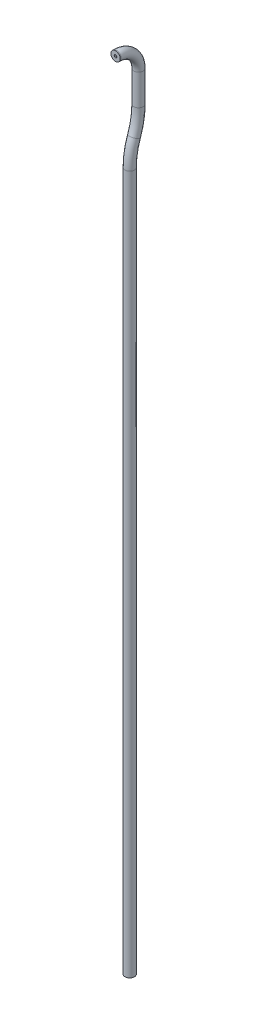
ISO-10303-21;
HEADER;
FILE_DESCRIPTION(('STEP AP214'),'2;1');
FILE_NAME('part.step','',(''),(''),'','','');
FILE_SCHEMA(('AUTOMOTIVE_DESIGN { 1 0 10303 214 1 1 1 1 }'));
ENDSEC;
DATA;
#1=APPLICATION_CONTEXT('core data for automotive mechanical design processes');
#2=APPLICATION_PROTOCOL_DEFINITION('international standard','automotive_design',2000,#1);
#3=PRODUCT_CONTEXT('',#1,'mechanical');
#4=PRODUCT('Part','Part','',(#3));
#5=PRODUCT_RELATED_PRODUCT_CATEGORY('part','',(#4));
#6=PRODUCT_DEFINITION_FORMATION('','',#4);
#7=PRODUCT_DEFINITION_CONTEXT('part definition',#1,'design');
#8=PRODUCT_DEFINITION('design','',#6,#7);
#9=PRODUCT_DEFINITION_SHAPE('','',#8);
#10=(LENGTH_UNIT() NAMED_UNIT(*) SI_UNIT(.MILLI.,.METRE.));
#11=(NAMED_UNIT(*) PLANE_ANGLE_UNIT() SI_UNIT($,.RADIAN.));
#12=(NAMED_UNIT(*) SI_UNIT($,.STERADIAN.) SOLID_ANGLE_UNIT());
#13=UNCERTAINTY_MEASURE_WITH_UNIT(LENGTH_MEASURE(1.E-05),#10,'distance_accuracy_value','');
#14=(GEOMETRIC_REPRESENTATION_CONTEXT(3) GLOBAL_UNCERTAINTY_ASSIGNED_CONTEXT((#13)) GLOBAL_UNIT_ASSIGNED_CONTEXT((#10,
#11,#12)) REPRESENTATION_CONTEXT('',''));
#15=CARTESIAN_POINT('',(0.,0.,0.));
#16=DIRECTION('',(0.,0.,1.));
#17=DIRECTION('',(1.,0.,0.));
#18=AXIS2_PLACEMENT_3D('',#15,#16,#17);
#19=CARTESIAN_POINT('',(0.,-310.,-4.5));
#20=DIRECTION('',(0.,1.,0.));
#21=DIRECTION('',(0.,0.,-1.));
#22=AXIS2_PLACEMENT_3D('',#19,#20,#21);
#23=PLANE('',#22);
#24=CARTESIAN_POINT('',(0.,-310.,-4.5));
#25=DIRECTION('',(0.,1.,0.));
#26=DIRECTION('',(0.,0.,1.));
#27=AXIS2_PLACEMENT_3D('',#24,#25,#26);
#28=CIRCLE('',#27,0.45);
#29=CARTESIAN_POINT('',(0.,-310.,-4.05));
#30=VERTEX_POINT('',#29);
#31=EDGE_CURVE('E27',#30,#30,#28,.T.);
#32=ORIENTED_EDGE('',*,*,#31,.T.);
#33=EDGE_LOOP('',(#32));
#34=FACE_BOUND('',#33,.T.);
#35=CARTESIAN_POINT('',(0.,-310.,-4.5));
#36=DIRECTION('',(0.,1.,0.));
#37=DIRECTION('',(0.,0.,1.));
#38=AXIS2_PLACEMENT_3D('',#35,#36,#37);
#39=CIRCLE('',#38,1.6);
#40=CARTESIAN_POINT('',(0.,-310.,-2.9));
#41=VERTEX_POINT('',#40);
#42=EDGE_CURVE('E81',#41,#41,#39,.T.);
#43=ORIENTED_EDGE('',*,*,#42,.F.);
#44=EDGE_LOOP('',(#43));
#45=FACE_BOUND('',#44,.T.);
#46=ADVANCED_FACE('F16',(#34,#45),#23,.F.);
#47=CARTESIAN_POINT('',(0.,-310.,-4.5));
#48=DIRECTION('',(0.,1.,0.));
#49=DIRECTION('',(0.,0.,1.));
#50=AXIS2_PLACEMENT_3D('',#47,#48,#49);
#51=CYLINDRICAL_SURFACE('',#50,0.45);
#52=ORIENTED_EDGE('',*,*,#31,.F.);
#53=DIRECTION('',(0.,1.,0.));
#54=VECTOR('',#53,1.);
#55=CARTESIAN_POINT('',(0.,-310.,-4.05));
#56=LINE('',#55,#54);
#57=CARTESIAN_POINT('',(0.,-71.8,-4.05));
#58=VERTEX_POINT('',#57);
#59=EDGE_CURVE('E10',#30,#58,#56,.T.);
#60=ORIENTED_EDGE('',*,*,#59,.T.);
#61=CARTESIAN_POINT('',(0.,-71.8,-4.5));
#62=DIRECTION('',(0.,1.,0.));
#63=DIRECTION('',(0.,0.,1.));
#64=AXIS2_PLACEMENT_3D('',#61,#62,#63);
#65=CIRCLE('',#64,0.45);
#66=EDGE_CURVE('E158',#58,#58,#65,.T.);
#67=ORIENTED_EDGE('',*,*,#66,.T.);
#68=ORIENTED_EDGE('',*,*,#59,.F.);
#69=EDGE_LOOP('',(#52,#60,#67,#68));
#70=FACE_BOUND('',#69,.T.);
#71=ADVANCED_FACE('F228',(#70),#51,.F.);
#72=CARTESIAN_POINT('',(0.,-71.8,-29.90333333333));
#73=DIRECTION('',(-1.,0.,0.));
#74=DIRECTION('',(0.,0.,1.));
#75=AXIS2_PLACEMENT_3D('',#72,#73,#74);
#76=TOROIDAL_SURFACE('',#75,25.403333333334,0.45);
#77=ORIENTED_EDGE('',*,*,#66,.F.);
#78=CARTESIAN_POINT('',(0.,-71.8,-29.90333333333));
#79=DIRECTION('',(-1.,0.,0.));
#80=DIRECTION('',(0.,0.,1.));
#81=AXIS2_PLACEMENT_3D('',#78,#79,#80);
#82=CIRCLE('',#81,25.853333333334);
#83=CARTESIAN_POINT('',(0.,-63.04765778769,-5.5765713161));
#84=VERTEX_POINT('',#83);
#85=EDGE_CURVE('E160',#58,#84,#82,.T.);
#86=ORIENTED_EDGE('',*,*,#85,.T.);
#87=CARTESIAN_POINT('',(0.,-63.2,-6.));
#88=DIRECTION('',(0.,-0.940952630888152,0.338538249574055));
#89=DIRECTION('',(0.,0.338538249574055,0.940952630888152));
#90=AXIS2_PLACEMENT_3D('',#87,#88,#89);
#91=CIRCLE('',#90,0.45);
#92=EDGE_CURVE('E188',#84,#84,#91,.T.);
#93=ORIENTED_EDGE('',*,*,#92,.F.);
#94=ORIENTED_EDGE('',*,*,#85,.F.);
#95=EDGE_LOOP('',(#77,#86,#93,#94));
#96=FACE_BOUND('',#95,.T.);
#97=ADVANCED_FACE('F234',(#96),#76,.F.);
#98=CARTESIAN_POINT('',(0.,-54.6,17.903333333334));
#99=DIRECTION('',(1.,0.,0.));
#100=DIRECTION('',(0.,-0.338538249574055,-0.940952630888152));
#101=AXIS2_PLACEMENT_3D('',#98,#99,#100);
#102=TOROIDAL_SURFACE('',#101,25.403333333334,0.45);
#103=ORIENTED_EDGE('',*,*,#92,.T.);
#104=CARTESIAN_POINT('',(0.,-54.6,17.903333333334));
#105=DIRECTION('',(1.,0.,0.));
#106=DIRECTION('',(0.,-0.338538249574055,-0.940952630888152));
#107=AXIS2_PLACEMENT_3D('',#104,#105,#106);
#108=CIRCLE('',#107,24.953333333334);
#109=CARTESIAN_POINT('',(0.,-54.6,-7.05));
#110=VERTEX_POINT('',#109);
#111=EDGE_CURVE('E20',#84,#110,#108,.T.);
#112=ORIENTED_EDGE('',*,*,#111,.T.);
#113=CARTESIAN_POINT('',(0.,-54.6,-7.5));
#114=DIRECTION('',(0.,-1.,0.));
#115=DIRECTION('',(0.,0.,-1.));
#116=AXIS2_PLACEMENT_3D('',#113,#114,#115);
#117=CIRCLE('',#116,0.45);
#118=EDGE_CURVE('E165',#110,#110,#117,.T.);
#119=ORIENTED_EDGE('',*,*,#118,.F.);
#120=ORIENTED_EDGE('',*,*,#111,.F.);
#121=EDGE_LOOP('',(#103,#112,#119,#120));
#122=FACE_BOUND('',#121,.T.);
#123=ADVANCED_FACE('F242',(#122),#102,.F.);
#124=CARTESIAN_POINT('',(0.,-54.6,-7.5));
#125=DIRECTION('',(0.,1.,0.));
#126=DIRECTION('',(0.,0.,1.));
#127=AXIS2_PLACEMENT_3D('',#124,#125,#126);
#128=CYLINDRICAL_SURFACE('',#127,0.45);
#129=DIRECTION('',(0.,-1.,0.));
#130=VECTOR('',#129,1.);
#131=CARTESIAN_POINT('',(0.,-44.065,-7.05));
#132=LINE('',#131,#130);
#133=CARTESIAN_POINT('',(0.,-44.065,-7.05));
#134=VERTEX_POINT('',#133);
#135=EDGE_CURVE('E161',#134,#110,#132,.T.);
#136=ORIENTED_EDGE('',*,*,#135,.F.);
#137=CARTESIAN_POINT('',(0.,-44.065,-7.5));
#138=DIRECTION('',(0.,1.,0.));
#139=DIRECTION('',(0.,0.,1.));
#140=AXIS2_PLACEMENT_3D('',#137,#138,#139);
#141=CIRCLE('',#140,0.45);
#142=EDGE_CURVE('E147',#134,#134,#141,.T.);
#143=ORIENTED_EDGE('',*,*,#142,.T.);
#144=ORIENTED_EDGE('',*,*,#135,.T.);
#145=ORIENTED_EDGE('',*,*,#118,.T.);
#146=EDGE_LOOP('',(#136,#143,#144,#145));
#147=FACE_BOUND('',#146,.T.);
#148=ADVANCED_FACE('F238',(#147),#128,.F.);
#149=CARTESIAN_POINT('',(0.,-44.065,0.));
#150=DIRECTION('',(1.,0.,0.));
#151=DIRECTION('',(0.,0.,-1.));
#152=AXIS2_PLACEMENT_3D('',#149,#150,#151);
#153=TOROIDAL_SURFACE('',#152,7.5,0.45);
#154=ORIENTED_EDGE('',*,*,#142,.F.);
#155=CARTESIAN_POINT('',(0.,-44.065,0.));
#156=DIRECTION('',(1.,0.,0.));
#157=DIRECTION('',(0.,0.,-1.));
#158=AXIS2_PLACEMENT_3D('',#155,#156,#157);
#159=CIRCLE('',#158,7.05);
#160=CARTESIAN_POINT('',(0.,-37.015,0.));
#161=VERTEX_POINT('',#160);
#162=EDGE_CURVE('E166',#134,#161,#159,.T.);
#163=ORIENTED_EDGE('',*,*,#162,.T.);
#164=CARTESIAN_POINT('',(0.,-36.565,0.));
#165=DIRECTION('',(0.,0.,-1.));
#166=DIRECTION('',(0.,1.,0.));
#167=AXIS2_PLACEMENT_3D('',#164,#165,#166);
#168=CIRCLE('',#167,0.45);
#169=EDGE_CURVE('E141',#161,#161,#168,.T.);
#170=ORIENTED_EDGE('',*,*,#169,.F.);
#171=ORIENTED_EDGE('',*,*,#162,.F.);
#172=EDGE_LOOP('',(#154,#163,#170,#171));
#173=FACE_BOUND('',#172,.T.);
#174=ADVANCED_FACE('F18',(#173),#153,.F.);
#175=CARTESIAN_POINT('',(0.,-36.565,0.));
#176=DIRECTION('',(0.,0.,1.));
#177=DIRECTION('',(0.,-1.,0.));
#178=AXIS2_PLACEMENT_3D('',#175,#176,#177);
#179=CYLINDRICAL_SURFACE('',#178,0.45);
#180=ORIENTED_EDGE('',*,*,#169,.T.);
#181=DIRECTION('',(0.,0.,1.));
#182=VECTOR('',#181,1.);
#183=CARTESIAN_POINT('',(0.,-37.015,0.));
#184=LINE('',#183,#182);
#185=CARTESIAN_POINT('',(0.,-37.015,0.33));
#186=VERTEX_POINT('',#185);
#187=EDGE_CURVE('E104',#161,#186,#184,.T.);
#188=ORIENTED_EDGE('',*,*,#187,.T.);
#189=CARTESIAN_POINT('',(0.,-36.565,0.33));
#190=DIRECTION('',(0.,0.,1.));
#191=DIRECTION('',(0.,-1.,0.));
#192=AXIS2_PLACEMENT_3D('',#189,#190,#191);
#193=CIRCLE('',#192,0.45);
#194=EDGE_CURVE('E142',#186,#186,#193,.T.);
#195=ORIENTED_EDGE('',*,*,#194,.T.);
#196=ORIENTED_EDGE('',*,*,#187,.F.);
#197=EDGE_LOOP('',(#180,#188,#195,#196));
#198=FACE_BOUND('',#197,.T.);
#199=ADVANCED_FACE('F222',(#198),#179,.F.);
#200=CARTESIAN_POINT('',(0.,-36.565,0.33));
#201=DIRECTION('',(0.,0.,1.));
#202=DIRECTION('',(0.,-1.,0.));
#203=AXIS2_PLACEMENT_3D('',#200,#201,#202);
#204=PLANE('',#203);
#205=ORIENTED_EDGE('',*,*,#194,.F.);
#206=EDGE_LOOP('',(#205));
#207=FACE_BOUND('',#206,.T.);
#208=CARTESIAN_POINT('',(0.,-36.565,0.33));
#209=DIRECTION('',(0.,0.,1.));
#210=DIRECTION('',(0.,-1.,0.));
#211=AXIS2_PLACEMENT_3D('',#208,#209,#210);
#212=CIRCLE('',#211,1.6);
#213=CARTESIAN_POINT('',(0.,-38.165,0.33));
#214=VERTEX_POINT('',#213);
#215=EDGE_CURVE('E93',#214,#214,#212,.T.);
#216=ORIENTED_EDGE('',*,*,#215,.T.);
#217=EDGE_LOOP('',(#216));
#218=FACE_BOUND('',#217,.T.);
#219=ADVANCED_FACE('F214',(#207,#218),#204,.T.);
#220=CARTESIAN_POINT('',(0.,-36.565,0.));
#221=DIRECTION('',(0.,0.,1.));
#222=DIRECTION('',(0.,-1.,0.));
#223=AXIS2_PLACEMENT_3D('',#220,#221,#222);
#224=CYLINDRICAL_SURFACE('',#223,1.6);
#225=DIRECTION('',(0.,0.,1.));
#226=VECTOR('',#225,1.);
#227=CARTESIAN_POINT('',(0.,-38.165,0.));
#228=LINE('',#227,#226);
#229=CARTESIAN_POINT('',(0.,-38.165,0.));
#230=VERTEX_POINT('',#229);
#231=EDGE_CURVE('E154',#230,#214,#228,.T.);
#232=ORIENTED_EDGE('',*,*,#231,.T.);
#233=ORIENTED_EDGE('',*,*,#215,.F.);
#234=ORIENTED_EDGE('',*,*,#231,.F.);
#235=CARTESIAN_POINT('',(0.,-36.565,0.));
#236=DIRECTION('',(0.,0.,-1.));
#237=DIRECTION('',(0.,1.,0.));
#238=AXIS2_PLACEMENT_3D('',#235,#236,#237);
#239=CIRCLE('',#238,1.6);
#240=EDGE_CURVE('E179',#230,#230,#239,.T.);
#241=ORIENTED_EDGE('',*,*,#240,.F.);
#242=EDGE_LOOP('',(#232,#233,#234,#241));
#243=FACE_BOUND('',#242,.T.);
#244=ADVANCED_FACE('F212',(#243),#224,.T.);
#245=CARTESIAN_POINT('',(0.,-44.065,0.));
#246=DIRECTION('',(1.,0.,0.));
#247=DIRECTION('',(0.,0.,-1.));
#248=AXIS2_PLACEMENT_3D('',#245,#246,#247);
#249=TOROIDAL_SURFACE('',#248,7.5,1.6);
#250=CARTESIAN_POINT('',(0.,-44.065,0.));
#251=DIRECTION('',(1.,0.,0.));
#252=DIRECTION('',(0.,0.,-1.));
#253=AXIS2_PLACEMENT_3D('',#250,#251,#252);
#254=CIRCLE('',#253,5.9);
#255=CARTESIAN_POINT('',(0.,-44.065,-5.9));
#256=VERTEX_POINT('',#255);
#257=EDGE_CURVE('E112',#256,#230,#254,.T.);
#258=ORIENTED_EDGE('',*,*,#257,.T.);
#259=ORIENTED_EDGE('',*,*,#240,.T.);
#260=ORIENTED_EDGE('',*,*,#257,.F.);
#261=CARTESIAN_POINT('',(0.,-44.065,-7.5));
#262=DIRECTION('',(0.,1.,0.));
#263=DIRECTION('',(0.,0.,1.));
#264=AXIS2_PLACEMENT_3D('',#261,#262,#263);
#265=CIRCLE('',#264,1.6);
#266=EDGE_CURVE('E124',#256,#256,#265,.T.);
#267=ORIENTED_EDGE('',*,*,#266,.T.);
#268=EDGE_LOOP('',(#258,#259,#260,#267));
#269=FACE_BOUND('',#268,.T.);
#270=ADVANCED_FACE('F209',(#269),#249,.T.);
#271=CARTESIAN_POINT('',(0.,-54.6,-7.5));
#272=DIRECTION('',(0.,1.,0.));
#273=DIRECTION('',(0.,0.,1.));
#274=AXIS2_PLACEMENT_3D('',#271,#272,#273);
#275=CYLINDRICAL_SURFACE('',#274,1.6);
#276=CARTESIAN_POINT('',(0.,-54.6,-7.5));
#277=DIRECTION('',(0.,-1.,0.));
#278=DIRECTION('',(0.,0.,-1.));
#279=AXIS2_PLACEMENT_3D('',#276,#277,#278);
#280=CIRCLE('',#279,1.6);
#281=CARTESIAN_POINT('',(0.,-54.6,-5.9));
#282=VERTEX_POINT('',#281);
#283=EDGE_CURVE('E122',#282,#282,#280,.T.);
#284=ORIENTED_EDGE('',*,*,#283,.F.);
#285=DIRECTION('',(0.,1.,0.));
#286=VECTOR('',#285,1.);
#287=CARTESIAN_POINT('',(0.,-54.6,-5.9));
#288=LINE('',#287,#286);
#289=EDGE_CURVE('E119',#282,#256,#288,.T.);
#290=ORIENTED_EDGE('',*,*,#289,.T.);
#291=ORIENTED_EDGE('',*,*,#266,.F.);
#292=ORIENTED_EDGE('',*,*,#289,.F.);
#293=EDGE_LOOP('',(#284,#290,#291,#292));
#294=FACE_BOUND('',#293,.T.);
#295=ADVANCED_FACE('F121',(#294),#275,.T.);
#296=CARTESIAN_POINT('',(0.,-54.6,17.903333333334));
#297=DIRECTION('',(1.,0.,0.));
#298=DIRECTION('',(0.,-0.338538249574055,-0.940952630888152));
#299=AXIS2_PLACEMENT_3D('',#296,#297,#298);
#300=TOROIDAL_SURFACE('',#299,25.403333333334,1.6);
#301=CARTESIAN_POINT('',(0.,-54.6,17.903333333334));
#302=DIRECTION('',(1.,0.,0.));
#303=DIRECTION('',(0.,-0.338538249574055,-0.940952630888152));
#304=AXIS2_PLACEMENT_3D('',#301,#302,#303);
#305=CIRCLE('',#304,23.803333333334);
#306=CARTESIAN_POINT('',(0.,-62.65833880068,-4.494475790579));
#307=VERTEX_POINT('',#306);
#308=EDGE_CURVE('E130',#307,#282,#305,.T.);
#309=ORIENTED_EDGE('',*,*,#308,.T.);
#310=ORIENTED_EDGE('',*,*,#283,.T.);
#311=ORIENTED_EDGE('',*,*,#308,.F.);
#312=CARTESIAN_POINT('',(0.,-63.2,-6.));
#313=DIRECTION('',(0.,-0.940952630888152,0.338538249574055));
#314=DIRECTION('',(0.,0.338538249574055,0.940952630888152));
#315=AXIS2_PLACEMENT_3D('',#312,#313,#314);
#316=CIRCLE('',#315,1.6);
#317=EDGE_CURVE('E137',#307,#307,#316,.T.);
#318=ORIENTED_EDGE('',*,*,#317,.F.);
#319=EDGE_LOOP('',(#309,#310,#311,#318));
#320=FACE_BOUND('',#319,.T.);
#321=ADVANCED_FACE('F128',(#320),#300,.T.);
#322=CARTESIAN_POINT('',(0.,-71.8,-29.90333333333));
#323=DIRECTION('',(-1.,0.,0.));
#324=DIRECTION('',(0.,0.,1.));
#325=AXIS2_PLACEMENT_3D('',#322,#323,#324);
#326=TOROIDAL_SURFACE('',#325,25.403333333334,1.6);
#327=CARTESIAN_POINT('',(0.,-71.8,-29.90333333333));
#328=DIRECTION('',(-1.,0.,0.));
#329=DIRECTION('',(0.,0.,1.));
#330=AXIS2_PLACEMENT_3D('',#327,#328,#329);
#331=CIRCLE('',#330,27.003333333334);
#332=CARTESIAN_POINT('',(0.,-71.8,-2.9));
#333=VERTEX_POINT('',#332);
#334=EDGE_CURVE('E68',#333,#307,#331,.T.);
#335=ORIENTED_EDGE('',*,*,#334,.T.);
#336=ORIENTED_EDGE('',*,*,#317,.T.);
#337=ORIENTED_EDGE('',*,*,#334,.F.);
#338=CARTESIAN_POINT('',(0.,-71.8,-4.5));
#339=DIRECTION('',(0.,1.,0.));
#340=DIRECTION('',(0.,0.,1.));
#341=AXIS2_PLACEMENT_3D('',#338,#339,#340);
#342=CIRCLE('',#341,1.6);
#343=EDGE_CURVE('E181',#333,#333,#342,.T.);
#344=ORIENTED_EDGE('',*,*,#343,.T.);
#345=EDGE_LOOP('',(#335,#336,#337,#344));
#346=FACE_BOUND('',#345,.T.);
#347=ADVANCED_FACE('F241',(#346),#326,.T.);
#348=CARTESIAN_POINT('',(0.,-310.,-4.5));
#349=DIRECTION('',(0.,1.,0.));
#350=DIRECTION('',(0.,0.,1.));
#351=AXIS2_PLACEMENT_3D('',#348,#349,#350);
#352=CYLINDRICAL_SURFACE('',#351,1.6);
#353=DIRECTION('',(0.,1.,0.));
#354=VECTOR('',#353,1.);
#355=CARTESIAN_POINT('',(0.,-310.,-2.9));
#356=LINE('',#355,#354);
#357=EDGE_CURVE('E184',#41,#333,#356,.T.);
#358=ORIENTED_EDGE('',*,*,#357,.T.);
#359=ORIENTED_EDGE('',*,*,#343,.F.);
#360=ORIENTED_EDGE('',*,*,#357,.F.);
#361=ORIENTED_EDGE('',*,*,#42,.T.);
#362=EDGE_LOOP('',(#358,#359,#360,#361));
#363=FACE_BOUND('',#362,.T.);
#364=ADVANCED_FACE('F248',(#363),#352,.T.);
#365=CLOSED_SHELL('',(#46,#71,#97,#123,#148,#174,#199,#219,#244,#270,#295,#321,#347,#364));
#366=MANIFOLD_SOLID_BREP('B1',#365);
#367=ADVANCED_BREP_SHAPE_REPRESENTATION('',(#18,#366),#14);
#368=SHAPE_DEFINITION_REPRESENTATION(#9,#367);
ENDSEC;
END-ISO-10303-21;
